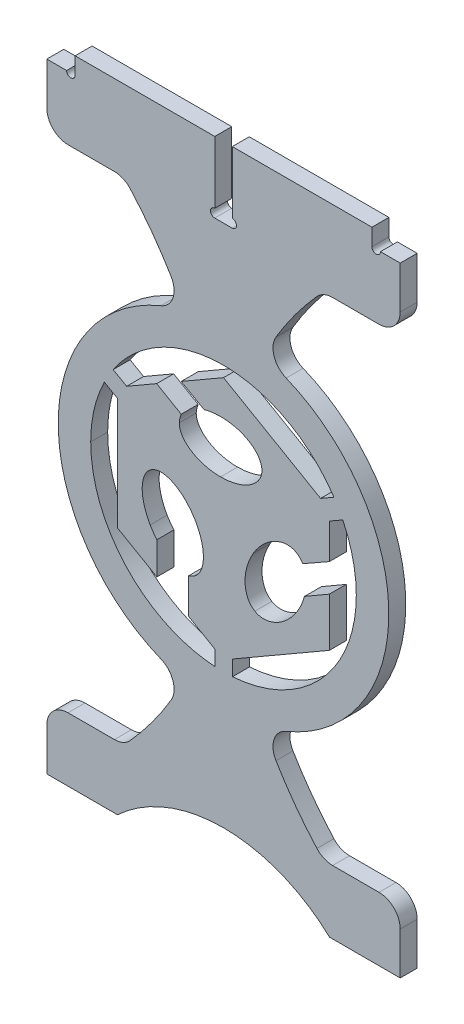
from build123d import *

# Parameters (mm, degrees)
LEG_EXTRUDE_DEPTH    = 12
CUT_EXTRUDE1_DEPTH   = 263.925845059
CUT_EXTRUDE3_DEPTH   = 263.925845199
CUT_EXTRUDE5_DEPTH   = 263.925845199
MIRROR2_COPY_1_DEPTH = 263.925845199


with BuildPart() as part:
    # Leg_Profile → Leg_Extrude (new body)
    with BuildSketch(Plane.XY):
        with BuildLine():
            Line((-105, 231), (105, 231))
            Line((105, 231), (105, 219))
            ThreePointArc((105, 219), (108, 216), (111, 219))
            Line((111, 219), (125, 219))
            Line((125, 219), (125, -219))
            Line((125, -219), (75, -219))
            ThreePointArc((75, -219), (0, -189.467384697), (-75, -219))
            Line((-75, -219), (-125, -219))
            Line((-125, -219), (-125, 219))
            Line((-125, 219), (-111, 219))
            ThreePointArc((-111, 219), (-108, 216), (-105, 219))
            Line((-105, 219), (-105, 231))
        make_face()
    extrude(amount=LEG_EXTRUDE_DEPTH)

    # Sketch2 → Cut-Extrude1 (cut, through all)
    with BuildSketch(Plane.XY.offset(12)):
        with BuildLine():
            Line((-68.548586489, 46.742749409), (-47.282892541, 59.01693998))
            Line((-47.282892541, 59.01693998), (-29.932625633, 48.963152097))
            add(Edge.make_bspline(
                [(-29.932625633, 48.963152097), (-30.025863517, 48.680076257), (-30.212039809, 48.114705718), (-30.446257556, 47.404086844), (-30.607458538, 46.913830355), (-30.703840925, 46.622552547), (-30.807771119, 46.298220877), (-31.025011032, 45.5280832), (-31.239330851, 44.384644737), (-31.300392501, 43.431150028), (-31.300392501, 42.957860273)],
                knots=[-0.5162611, -0.5162611, -0.5162611, -0.5162611, -0.326728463, -0.137195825, -0.042429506, 0.004953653, 0.052336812, 0.24186945, 0.620934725, 1, 1, 1, 1], degree=3))
            add(Edge.make_bspline(
                [(-31.300392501, 42.957860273), (-31.300392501, 40.603193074), (-30.252998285, 37.226032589), (-26.848485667, 33.030276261), (-23.337824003, 30.189523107), (-18.977833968, 27.784567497), (-13.899046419, 25.937864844), (-9.173538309, 24.952103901), (-5.182127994, 24.543027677), (-3.098344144, 24.472414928), (-2.066586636, 24.472414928)],
                knots=[0, 0, 0, 0, 0.25, 0.375, 0.5, 0.625, 0.75, 0.875, 0.9375, 1, 1, 1, 1], degree=3))
            add(Edge.make_bspline(
                [(-2.066586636, 24.472414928), (-1.035209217, 24.472414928), (1.047747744, 24.543024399), (5.03803388, 24.952088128), (9.762681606, 25.937834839), (14.841210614, 27.78455038), (19.201457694, 30.189570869), (22.712660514, 33.030421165), (26.11794085, 37.226385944), (27.165607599, 40.603223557), (27.165607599, 42.957860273)],
                knots=[0, 0, 0, 0, 0.0625, 0.125, 0.25, 0.375, 0.5, 0.625, 0.75, 1, 1, 1, 1], degree=3))
            add(Edge.make_bspline(
                [(27.165607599, 42.957860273), (27.165607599, 45.313079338), (26.117821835, 48.691597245), (22.712795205, 52.88679554), (19.201770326, 55.726986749), (14.8416188, 58.131156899), (9.763068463, 59.977066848), (5.038304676, 60.962295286), (1.047879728, 61.371123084), (-1.035167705, 61.441688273), (-2.066586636, 61.441688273)],
                knots=[0, 0, 0, 0, 0.25, 0.375, 0.5, 0.625, 0.75, 0.875, 0.9375, 1, 1, 1, 1], degree=3))
            add(Edge.make_bspline(
                [(-2.066586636, 61.441688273), (-3.088012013, 61.441688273), (-5.151680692, 61.372116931), (-8.112046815, 61.071965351), (-10.516060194, 60.661962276), (-12.110570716, 60.306970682), (-13.058631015, 60.069319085), (-13.552095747, 59.946879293), (-13.79639879, 59.886111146)],
                knots=[0, 0, 0, 0, 0.277541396, 0.555082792, 0.832624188, 0.971394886, 1.040780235, 1.110165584, 1.110165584, 1.110165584, 1.110165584], degree=3))
            Line((-13.79639879, 59.886111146), (-29.916670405, 69.045811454))
            Line((-29.916670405, 69.045811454), (-6.2562e-05, 86.308731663))
            Line((-6.2562e-05, 86.308731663), (68.673035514, 46.660972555))
            add(Edge.make_bspline(
                [(68.673035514, 46.660972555), (69.518098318, 47.149168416), (71.233930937, 48.140235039), (73.653976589, 49.537852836), (75.581125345, 50.650924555), (77.062590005, 51.506821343), (77.771341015, 51.916401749), (78.12969207, 52.123526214)],
                knots=[0.096942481, 0.096942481, 0.096942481, 0.096942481, 0.265789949, 0.434637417, 0.603484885, 0.687908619, 0.772332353, 0.772332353, 0.772332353, 0.772332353], degree=3))
            add(Edge.make_bspline(
                [(78.12969207, 52.123526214), (76.02866205, 55.265986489), (71.438865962, 61.308316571), (63.549463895, 69.452232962), (54.732195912, 76.60764573), (45.086315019, 82.67321437), (34.703785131, 87.557127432), (23.680499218, 91.165793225), (14.027691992, 93.032941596), (6.089075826, 93.795696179), (2.022281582, 93.925491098), (-0.000459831, 93.925491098)],
                knots=[0.032945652, 0.032945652, 0.032945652, 0.032945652, 0.153827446, 0.274709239, 0.395591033, 0.516472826, 0.63735462, 0.758236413, 0.879118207, 0.939559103, 1, 1, 1, 1], degree=3))
            add(Edge.make_bspline(
                [(-0.000459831, 93.925491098), (-2.020409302, 93.925491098), (-6.081545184, 93.79607638), (-14.009549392, 93.03553492), (-23.650070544, 91.173751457), (-34.660632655, 87.575289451), (-45.032747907, 82.704964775), (-54.670877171, 76.655975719), (-63.483378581, 69.519783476), (-71.371422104, 61.397204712), (-75.962627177, 55.370587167), (-78.065172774, 52.235977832)],
                knots=[0, 0, 0, 0, 0.060434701, 0.120869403, 0.241738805, 0.362608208, 0.483477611, 0.604347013, 0.725216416, 0.846085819, 0.966955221, 0.966955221, 0.966955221, 0.966955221], degree=3))
            add(Edge.make_bspline(
                [(-78.065172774, 52.235977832), (-77.699355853, 52.024619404), (-76.974589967, 51.605972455), (-75.469616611, 50.736981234), (-73.523433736, 49.613702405), (-71.095701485, 48.212786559), (-69.390357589, 47.228627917), (-68.548586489, 46.742749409)],
                knots=[0.222315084, 0.222315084, 0.222315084, 0.222315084, 0.307236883, 0.392158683, 0.562002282, 0.731845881, 0.90168948, 0.90168948, 0.90168948, 0.90168948], degree=3))
        make_face()
        with BuildLine():
            Line((-74.869670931, -43.351623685), (-74.869670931, 36.014473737))
            Line((-74.869670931, 36.014473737), (-84.306241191, 41.462328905))
            add(Edge.make_bspline(
                [(-84.306241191, 41.462328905), (-85.854501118, 38.323343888), (-88.593546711, 31.891057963), (-91.634822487, 21.69470997), (-93.201910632, 12.82594476), (-93.841607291, 5.551185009), (-93.950268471, 1.832491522), (-93.950268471, -0.017865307)],
                knots=[0.06906515, 0.06906515, 0.06906515, 0.06906515, 0.301798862, 0.534532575, 0.767266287, 0.883633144, 1, 1, 1, 1], degree=3))
            add(Edge.make_bspline(
                [(-93.950268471, -0.017865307), (-93.950268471, -1.567645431), (-93.874378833, -4.679864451), (-93.426201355, -10.792056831), (-92.323560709, -18.281671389), (-90.174627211, -26.966111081), (-86.263927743, -38.095572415), (-79.519014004, -51.058307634), (-68.787693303, -64.762384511), (-55.755572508, -76.276729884), (-43.26106459, -83.766493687), (-32.452743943, -88.328382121), (-23.982792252, -90.99339157), (-16.651192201, -92.549635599), (-10.651614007, -93.374419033), (-7.593989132, -93.644278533), (-6.068197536, -93.741630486)],
                knots=[0, 0, 0, 0, 0.030609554, 0.061219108, 0.122438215, 0.183657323, 0.244876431, 0.367314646, 0.489752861, 0.612191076, 0.734629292, 0.795848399, 0.857067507, 0.918286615, 0.948896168, 0.979505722, 0.979505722, 0.979505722, 0.979505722], degree=3))
            Line((-6.068197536, -93.741630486), (-6.068197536, -83.063056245))
            Line((-6.068197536, -83.063056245), (-24.648805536, -72.340493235))
            Line((-24.648805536, -72.340493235), (-24.648805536, -47.38490234))
            add(Edge.make_bspline(
                [(-24.648805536, -47.38490234), (-24.326692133, -47.251075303), (-23.690793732, -46.985611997), (-22.686975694, -46.574272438), (-21.91759237, -46.232764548), (-21.45721, -45.986586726), (-21.228888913, -45.850892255)],
                knots=[-0.92300797, -0.92300797, -0.92300797, -0.92300797, -0.440614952, 0.041778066, 0.524171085, 1.006564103, 1.006564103, 1.006564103, 1.006564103], degree=3))
            add(Edge.make_bspline(
                [(-21.228888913, -45.850892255), (-19.190330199, -44.665496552), (-16.786818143, -42.062706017), (-14.866061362, -37.011338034), (-14.170412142, -32.548817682), (-14.279025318, -27.570397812), (-15.231899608, -22.250214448), (-16.752541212, -17.667419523), (-18.403520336, -14.00892054), (-19.389201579, -12.170533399), (-19.907474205, -11.27786104)],
                knots=[-0.000401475, -0.000401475, -0.000401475, -0.000401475, 0.249696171, 0.374744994, 0.499793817, 0.62484264, 0.749891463, 0.874940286, 0.937464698, 0.999989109, 0.999989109, 0.999989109, 0.999989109], degree=3))
            add(Edge.make_bspline(
                [(-19.907474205, -11.27786104), (-20.425560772, -10.386305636), (-21.532905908, -8.621222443), (-23.891020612, -5.377248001), (-27.116692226, -1.787958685), (-31.264700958, 1.675003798), (-35.534798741, 4.236694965), (-39.755477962, 5.845485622), (-45.095159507, 6.682147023), (-48.542913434, 5.891334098), (-50.579939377, 4.70843137)],
                knots=[1.0898e-05, 1.0898e-05, 1.0898e-05, 1.0898e-05, 0.062511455, 0.125012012, 0.250013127, 0.375014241, 0.500015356, 0.62501647, 0.750017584, 1.000019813, 1.000019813, 1.000019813, 1.000019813], degree=3))
            add(Edge.make_bspline(
                [(-50.579939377, 4.70843137), (-52.615929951, 3.527409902), (-55.010309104, 0.927417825), (-56.92804634, -4.122852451), (-57.62092065, -8.585500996), (-57.510330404, -13.564289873), (-56.556126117, -18.884602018), (-55.035214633, -23.466911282), (-53.38458639, -27.124566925), (-52.399378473, -28.962207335), (-51.881335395, -29.854565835)],
                knots=[-1.9819e-05, -1.9819e-05, -1.9819e-05, -1.9819e-05, 0.249973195, 0.374969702, 0.49996621, 0.624962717, 0.749959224, 0.874955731, 0.937453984, 0.999952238, 0.999952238, 0.999952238, 0.999952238], degree=3))
            add(Edge.make_bspline(
                [(-51.881335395, -29.854565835), (-51.53021305, -30.457031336), (-50.794980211, -31.654476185), (-49.645108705, -33.349044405), (-48.630305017, -34.710178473), (-47.820835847, -35.718285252), (-47.361799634, -36.276543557), (-47.139069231, -36.548897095)],
                knots=[0.000325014, 0.000325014, 0.000325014, 0.000325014, 0.2865278, 0.572730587, 0.858933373, 1.002034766, 1.145136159, 1.145136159, 1.145136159, 1.145136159], degree=3))
            Line((-47.139069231, -36.548897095), (-47.139069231, -59.358523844))
            Line((-47.139069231, -59.358523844), (-74.869670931, -43.351623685))
        make_face()
        with BuildLine():
            Line((57.291875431, -19.056794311), (74.855846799, -8.891030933))
            Line((74.855846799, -8.891030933), (74.855846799, -43.35152081))
            Line((74.855846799, -43.35152081), (6.383403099, -82.880478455))
            Line((6.383403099, -82.880478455), (6.383403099, -93.718628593))
            add(Edge.make_bspline(
                [(6.383403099, -93.718628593), (7.904388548, -93.616583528), (10.952047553, -93.337685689), (16.931977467, -92.496502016), (24.238865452, -90.922672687), (32.679413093, -88.241032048), (43.449122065, -83.662605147), (55.897174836, -76.162178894), (68.878610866, -64.6492687), (79.566547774, -50.959063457), (86.283255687, -38.016741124), (90.177266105, -26.908036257), (92.316896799, -18.241153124), (93.414695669, -10.767683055), (93.860887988, -4.669142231), (93.936438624, -1.56409737), (93.936438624, -0.017865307)],
                knots=[0.02061879, 0.02061879, 0.02061879, 0.02061879, 0.051224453, 0.081830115, 0.143041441, 0.204252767, 0.265464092, 0.387886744, 0.510309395, 0.632732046, 0.755154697, 0.816366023, 0.877577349, 0.938788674, 0.969394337, 1, 1, 1, 1], degree=3))
            add(Edge.make_bspline(
                [(93.936438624, -0.017865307), (93.936438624, 1.826249), (93.828363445, 5.53230343), (93.192216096, 12.783159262), (91.634083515, 21.623999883), (88.610996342, 31.79102756), (85.889187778, 38.206879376), (84.350873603, 41.338643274)],
                knots=[0, 0, 0, 0, 0.116327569, 0.232655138, 0.465310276, 0.697965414, 0.930620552, 0.930620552, 0.930620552, 0.930620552], degree=3))
            Line((84.350873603, 41.338643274), (74.855846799, 35.856494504))
            Line((74.855846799, 35.856494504), (74.855846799, 11.024614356))
            Line((74.855846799, 11.024614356), (56.203317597, 0.450356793))
            add(Edge.make_bspline(
                [(56.203317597, 0.450356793), (56.000066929, 0.687582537), (55.592158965, 1.163629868), (55.089307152, 1.750709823), (54.724387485, 2.176327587), (54.535906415, 2.396796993), (54.29244987, 2.672749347), (53.720865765, 3.275893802), (52.790785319, 4.090991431), (51.964214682, 4.64863053), (51.535453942, 4.898082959)],
                knots=[-0.491558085, -0.491558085, -0.491558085, -0.491558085, -0.305145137, -0.11873219, -0.025525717, 0.02107752, 0.067680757, 0.254093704, 0.626919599, 0.999745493, 0.999745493, 0.999745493, 0.999745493], degree=3))
            add(Edge.make_bspline(
                [(51.535453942, 4.898082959), (49.498285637, 6.080963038), (46.050080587, 6.871557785), (40.710775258, 6.03459889), (36.490471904, 4.425587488), (32.220828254, 1.863707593), (28.073261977, -1.599381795), (24.847899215, -5.188690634), (22.48996084, -8.432608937), (21.382677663, -10.197631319), (20.864611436, -11.089151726)],
                knots=[3.6141e-05, 3.6141e-05, 3.6141e-05, 3.6141e-05, 0.250024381, 0.375018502, 0.500012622, 0.625006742, 0.750000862, 0.874994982, 0.937492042, 0.999989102, 0.999989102, 0.999989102, 0.999989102], degree=3))
            add(Edge.make_bspline(
                [(20.864611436, -11.089151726), (20.346563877, -11.981436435), (19.361317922, -13.818971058), (17.710793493, -17.476089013), (16.190124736, -22.057497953), (15.236233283, -27.376710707), (15.125809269, -32.354873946), (15.818590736, -36.817851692), (17.736140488, -41.870588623), (20.130026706, -44.474633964), (22.166107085, -45.659186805)],
                knots=[1.089e-05, 1.089e-05, 1.089e-05, 1.089e-05, 0.062506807, 0.125002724, 0.249994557, 0.374986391, 0.499978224, 0.624970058, 0.749961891, 0.999945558, 0.999945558, 0.999945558, 0.999945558], degree=3))
            add(Edge.make_bspline(
                [(22.166107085, -45.659186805), (24.203601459, -46.841041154), (27.65117914, -47.63020417), (32.990764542, -46.792693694), (37.21096505, -45.183464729), (41.480469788, -42.621446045), (45.627861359, -39.157996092), (48.853109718, -35.567894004), (51.210951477, -32.322968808), (52.318237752, -30.557123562), (52.836286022, -29.665235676)],
                knots=[5.4451e-05, 5.4451e-05, 5.4451e-05, 5.4451e-05, 0.250044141, 0.375038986, 0.500033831, 0.625028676, 0.750023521, 0.875018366, 0.937515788, 1.000013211, 1.000013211, 1.000013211, 1.000013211], degree=3))
            add(Edge.make_bspline(
                [(52.836286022, -29.665235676), (53.33520779, -28.807205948), (54.286196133, -27.040613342), (55.486306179, -24.409775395), (56.325094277, -22.190603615), (56.811634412, -20.681794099), (57.081332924, -19.765611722), (57.222195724, -19.291752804), (57.291875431, -19.056794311)],
                knots=[-6.1123e-05, -6.1123e-05, -6.1123e-05, -6.1123e-05, 0.278209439, 0.55648, 0.834750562, 0.973885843, 1.043453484, 1.113021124, 1.113021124, 1.113021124, 1.113021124], degree=3))
        make_face()
    extrude(amount=-CUT_EXTRUDE1_DEPTH, mode=Mode.SUBTRACT)

    # Sketch3 → Cut-Extrude3 (cut, through all)
    with BuildSketch(Plane.XY.offset(12)):
        with BuildLine():
            Line((-110, 174), (-77.170704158, 174))
            ThreePointArc((-77.170704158, 174), (-71.099286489, 172.716336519), (-66.067023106, 169.085051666))
            ThreePointArc((-66.067023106, 169.085051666), (-50.637222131, 150.138347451), (-37.106675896, 129.791832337))
            ThreePointArc((-37.106675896, 129.791832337), (-35.753630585, 117.353684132), (-44.300631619, 108.216560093))
            ThreePointArc((-44.300631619, 108.216560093), (-97.091667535, 65.165772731), (-116.933185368, 0))
            Line((-116.933185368, 0), (-125, 0))
            Line((-125, 0), (-125, 189))
            ThreePointArc((-125, 189), (-120.606601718, 178.393398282), (-110, 174))
        make_face()
    cut_extrude3 = extrude(amount=-CUT_EXTRUDE3_DEPTH, mode=Mode.SUBTRACT)

    # Mirror1: Cut-Extrude3 across plane
    add(cut_extrude3.mirror(Plane(origin=(0, 0, 0), x_dir=(0, 0, 1), z_dir=(1, 0, 0))), mode=Mode.SUBTRACT)

    # Crossbrace_Slot → Cut-Extrude5 (cut, through all)
    with BuildSketch(Plane.XY.offset(12)):
        with BuildLine():
            Line((-6.2, 231), (6.2, 231))
            Line((6.2, 231), (6.2, 187))
            ThreePointArc((6.2, 187), (9.2, 184), (6.2, 181))
            Line((6.2, 181), (-6.2, 181))
            ThreePointArc((-6.2, 181), (-9.2, 184), (-6.2, 187))
            Line((-6.2, 187), (-6.2, 231))
        make_face()
    extrude(amount=-CUT_EXTRUDE5_DEPTH, mode=Mode.SUBTRACT)

    # Mirror2: Cut-Extrude3 across plane
    add(cut_extrude3.mirror(Plane.ZX), mode=Mode.SUBTRACT)

    # Mirror2 copy 1 sketch → Mirror2 copy 1 (cut, through all)
    with BuildSketch(Plane(origin=(0, 0, 12), x_dir=(-1, 0, 0), z_dir=(0, 0, 1))):
        with BuildLine():
            Line((-110, 174), (-77.170704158, 174))
            ThreePointArc((-77.170704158, 174), (-71.099286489, 172.716336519), (-66.067023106, 169.085051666))
            ThreePointArc((-66.067023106, 169.085051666), (-50.637222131, 150.138347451), (-37.106675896, 129.791832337))
            ThreePointArc((-37.106675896, 129.791832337), (-35.753630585, 117.353684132), (-44.300631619, 108.216560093))
            ThreePointArc((-44.300631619, 108.216560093), (-97.091667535, 65.165772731), (-116.933185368, 0))
            Line((-116.933185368, 0), (-125, 0))
            Line((-125, 0), (-125, 189))
            ThreePointArc((-125, 189), (-120.606601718, 178.393398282), (-110, 174))
        make_face()
    extrude(amount=-MIRROR2_COPY_1_DEPTH, mode=Mode.SUBTRACT)


solid = part.part
